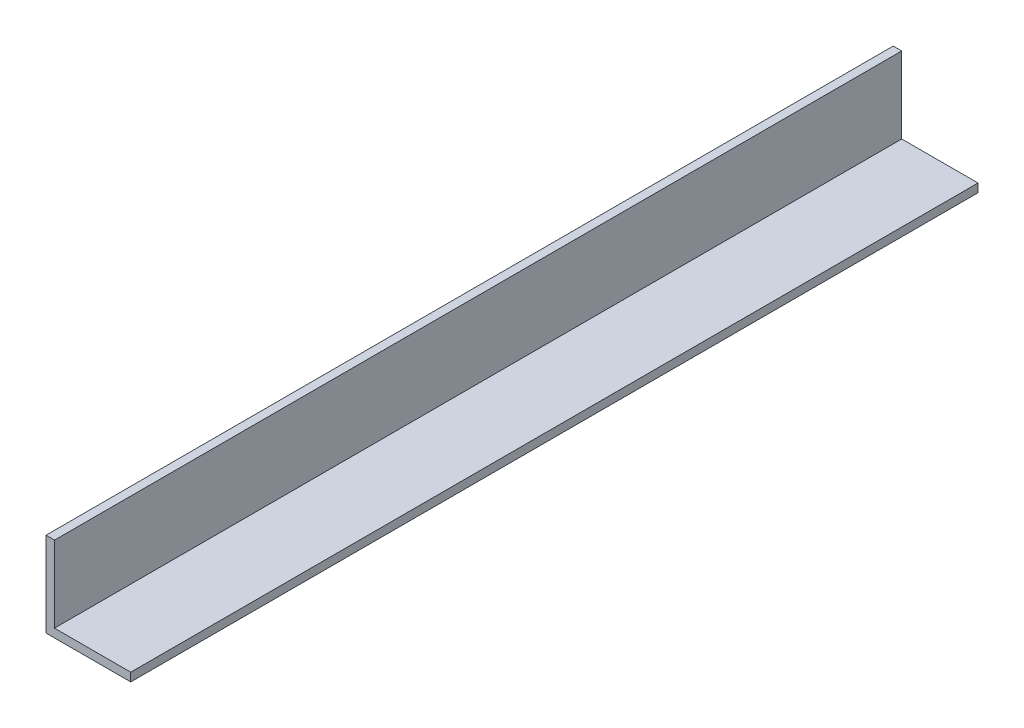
ISO-10303-21;
HEADER;
FILE_DESCRIPTION(('STEP AP214'),'2;1');
FILE_NAME('part.step','',(''),(''),'','','');
FILE_SCHEMA(('AUTOMOTIVE_DESIGN { 1 0 10303 214 1 1 1 1 }'));
ENDSEC;
DATA;
#1=APPLICATION_CONTEXT('core data for automotive mechanical design processes');
#2=APPLICATION_PROTOCOL_DEFINITION('international standard','automotive_design',2000,#1);
#3=PRODUCT_CONTEXT('',#1,'mechanical');
#4=PRODUCT('Part','Part','',(#3));
#5=PRODUCT_RELATED_PRODUCT_CATEGORY('part','',(#4));
#6=PRODUCT_DEFINITION_FORMATION('','',#4);
#7=PRODUCT_DEFINITION_CONTEXT('part definition',#1,'design');
#8=PRODUCT_DEFINITION('design','',#6,#7);
#9=PRODUCT_DEFINITION_SHAPE('','',#8);
#10=(LENGTH_UNIT() NAMED_UNIT(*) SI_UNIT(.MILLI.,.METRE.));
#11=(NAMED_UNIT(*) PLANE_ANGLE_UNIT() SI_UNIT($,.RADIAN.));
#12=(NAMED_UNIT(*) SI_UNIT($,.STERADIAN.) SOLID_ANGLE_UNIT());
#13=UNCERTAINTY_MEASURE_WITH_UNIT(LENGTH_MEASURE(1.E-05),#10,'distance_accuracy_value','');
#14=(GEOMETRIC_REPRESENTATION_CONTEXT(3) GLOBAL_UNCERTAINTY_ASSIGNED_CONTEXT((#13)) GLOBAL_UNIT_ASSIGNED_CONTEXT((#10,
#11,#12)) REPRESENTATION_CONTEXT('',''));
#15=CARTESIAN_POINT('',(0.,0.,0.));
#16=DIRECTION('',(0.,0.,1.));
#17=DIRECTION('',(1.,0.,0.));
#18=AXIS2_PLACEMENT_3D('',#15,#16,#17);
#19=CARTESIAN_POINT('',(27.,0.,150.));
#20=DIRECTION('',(0.,-1.,0.));
#21=DIRECTION('',(1.,0.,0.));
#22=AXIS2_PLACEMENT_3D('',#19,#20,#21);
#23=PLANE('',#22);
#24=DIRECTION('',(-1.,0.,0.));
#25=VECTOR('',#24,1.);
#26=CARTESIAN_POINT('',(27.,0.,-150.));
#27=LINE('',#26,#25);
#28=CARTESIAN_POINT('',(27.,0.,-150.));
#29=VERTEX_POINT('',#28);
#30=CARTESIAN_POINT('',(0.,0.,-150.));
#31=VERTEX_POINT('',#30);
#32=EDGE_CURVE('E120',#29,#31,#27,.T.);
#33=ORIENTED_EDGE('',*,*,#32,.T.);
#34=DIRECTION('',(0.,0.,-1.));
#35=VECTOR('',#34,1.);
#36=CARTESIAN_POINT('',(0.,0.,150.));
#37=LINE('',#36,#35);
#38=CARTESIAN_POINT('',(0.,0.,150.));
#39=VERTEX_POINT('',#38);
#40=EDGE_CURVE('E11',#39,#31,#37,.T.);
#41=ORIENTED_EDGE('',*,*,#40,.F.);
#42=DIRECTION('',(-1.,0.,0.));
#43=VECTOR('',#42,1.);
#44=CARTESIAN_POINT('',(27.,0.,150.));
#45=LINE('',#44,#43);
#46=CARTESIAN_POINT('',(27.,0.,150.));
#47=VERTEX_POINT('',#46);
#48=EDGE_CURVE('E130',#47,#39,#45,.T.);
#49=ORIENTED_EDGE('',*,*,#48,.F.);
#50=DIRECTION('',(0.,0.,-1.));
#51=VECTOR('',#50,1.);
#52=CARTESIAN_POINT('',(27.,0.,150.));
#53=LINE('',#52,#51);
#54=EDGE_CURVE('E116',#47,#29,#53,.T.);
#55=ORIENTED_EDGE('',*,*,#54,.T.);
#56=EDGE_LOOP('',(#33,#41,#49,#55));
#57=FACE_BOUND('',#56,.T.);
#58=ADVANCED_FACE('F36',(#57),#23,.F.);
#59=CARTESIAN_POINT('',(0.,0.,150.));
#60=DIRECTION('',(-1.,0.,0.));
#61=DIRECTION('',(0.,0.,1.));
#62=AXIS2_PLACEMENT_3D('',#59,#60,#61);
#63=PLANE('',#62);
#64=DIRECTION('',(0.,1.,0.));
#65=VECTOR('',#64,1.);
#66=CARTESIAN_POINT('',(0.,0.,-150.));
#67=LINE('',#66,#65);
#68=CARTESIAN_POINT('',(0.,27.,-150.));
#69=VERTEX_POINT('',#68);
#70=EDGE_CURVE('E123',#31,#69,#67,.T.);
#71=ORIENTED_EDGE('',*,*,#70,.T.);
#72=DIRECTION('',(0.,0.,-1.));
#73=VECTOR('',#72,1.);
#74=CARTESIAN_POINT('',(0.,27.,150.));
#75=LINE('',#74,#73);
#76=CARTESIAN_POINT('',(0.,27.,150.));
#77=VERTEX_POINT('',#76);
#78=EDGE_CURVE('E44',#77,#69,#75,.T.);
#79=ORIENTED_EDGE('',*,*,#78,.F.);
#80=DIRECTION('',(0.,1.,0.));
#81=VECTOR('',#80,1.);
#82=CARTESIAN_POINT('',(0.,0.,150.));
#83=LINE('',#82,#81);
#84=EDGE_CURVE('E89',#39,#77,#83,.T.);
#85=ORIENTED_EDGE('',*,*,#84,.F.);
#86=ORIENTED_EDGE('',*,*,#40,.T.);
#87=EDGE_LOOP('',(#71,#79,#85,#86));
#88=FACE_BOUND('',#87,.T.);
#89=ADVANCED_FACE('F154',(#88),#63,.F.);
#90=CARTESIAN_POINT('',(0.,27.,150.));
#91=DIRECTION('',(0.,-1.,0.));
#92=DIRECTION('',(0.,0.,-1.));
#93=AXIS2_PLACEMENT_3D('',#90,#91,#92);
#94=PLANE('',#93);
#95=DIRECTION('',(-1.,0.,0.));
#96=VECTOR('',#95,1.);
#97=CARTESIAN_POINT('',(0.,27.,-150.));
#98=LINE('',#97,#96);
#99=CARTESIAN_POINT('',(-3.,27.,-150.));
#100=VERTEX_POINT('',#99);
#101=EDGE_CURVE('E125',#69,#100,#98,.T.);
#102=ORIENTED_EDGE('',*,*,#101,.T.);
#103=DIRECTION('',(0.,0.,-1.));
#104=VECTOR('',#103,1.);
#105=CARTESIAN_POINT('',(-3.,27.,150.));
#106=LINE('',#105,#104);
#107=CARTESIAN_POINT('',(-3.,27.,150.));
#108=VERTEX_POINT('',#107);
#109=EDGE_CURVE('E111',#108,#100,#106,.T.);
#110=ORIENTED_EDGE('',*,*,#109,.F.);
#111=DIRECTION('',(-1.,0.,0.));
#112=VECTOR('',#111,1.);
#113=CARTESIAN_POINT('',(0.,27.,150.));
#114=LINE('',#113,#112);
#115=EDGE_CURVE('E102',#77,#108,#114,.T.);
#116=ORIENTED_EDGE('',*,*,#115,.F.);
#117=ORIENTED_EDGE('',*,*,#78,.T.);
#118=EDGE_LOOP('',(#102,#110,#116,#117));
#119=FACE_BOUND('',#118,.T.);
#120=ADVANCED_FACE('F136',(#119),#94,.F.);
#121=CARTESIAN_POINT('',(-3.,27.,150.));
#122=DIRECTION('',(1.,0.,0.));
#123=DIRECTION('',(0.,1.,0.));
#124=AXIS2_PLACEMENT_3D('',#121,#122,#123);
#125=PLANE('',#124);
#126=DIRECTION('',(0.,-1.,0.));
#127=VECTOR('',#126,1.);
#128=CARTESIAN_POINT('',(-3.,27.,-150.));
#129=LINE('',#128,#127);
#130=CARTESIAN_POINT('',(-3.,-3.,-150.));
#131=VERTEX_POINT('',#130);
#132=EDGE_CURVE('E110',#100,#131,#129,.T.);
#133=ORIENTED_EDGE('',*,*,#132,.T.);
#134=DIRECTION('',(0.,0.,-1.));
#135=VECTOR('',#134,1.);
#136=CARTESIAN_POINT('',(-3.,-3.,150.));
#137=LINE('',#136,#135);
#138=CARTESIAN_POINT('',(-3.,-3.,150.));
#139=VERTEX_POINT('',#138);
#140=EDGE_CURVE('E107',#139,#131,#137,.T.);
#141=ORIENTED_EDGE('',*,*,#140,.F.);
#142=DIRECTION('',(0.,-1.,0.));
#143=VECTOR('',#142,1.);
#144=CARTESIAN_POINT('',(-3.,27.,150.));
#145=LINE('',#144,#143);
#146=EDGE_CURVE('E96',#108,#139,#145,.T.);
#147=ORIENTED_EDGE('',*,*,#146,.F.);
#148=ORIENTED_EDGE('',*,*,#109,.T.);
#149=EDGE_LOOP('',(#133,#141,#147,#148));
#150=FACE_BOUND('',#149,.T.);
#151=ADVANCED_FACE('F108',(#150),#125,.F.);
#152=CARTESIAN_POINT('',(-3.,-3.,150.));
#153=DIRECTION('',(0.,1.,0.));
#154=DIRECTION('',(0.,0.,1.));
#155=AXIS2_PLACEMENT_3D('',#152,#153,#154);
#156=PLANE('',#155);
#157=DIRECTION('',(1.,0.,0.));
#158=VECTOR('',#157,1.);
#159=CARTESIAN_POINT('',(-3.,-3.,-150.));
#160=LINE('',#159,#158);
#161=CARTESIAN_POINT('',(27.,-3.,-150.));
#162=VERTEX_POINT('',#161);
#163=EDGE_CURVE('E75',#131,#162,#160,.T.);
#164=ORIENTED_EDGE('',*,*,#163,.T.);
#165=DIRECTION('',(0.,0.,-1.));
#166=VECTOR('',#165,1.);
#167=CARTESIAN_POINT('',(27.,-3.,150.));
#168=LINE('',#167,#166);
#169=CARTESIAN_POINT('',(27.,-3.,150.));
#170=VERTEX_POINT('',#169);
#171=EDGE_CURVE('E112',#170,#162,#168,.T.);
#172=ORIENTED_EDGE('',*,*,#171,.F.);
#173=DIRECTION('',(1.,0.,0.));
#174=VECTOR('',#173,1.);
#175=CARTESIAN_POINT('',(-3.,-3.,150.));
#176=LINE('',#175,#174);
#177=EDGE_CURVE('E100',#139,#170,#176,.T.);
#178=ORIENTED_EDGE('',*,*,#177,.F.);
#179=ORIENTED_EDGE('',*,*,#140,.T.);
#180=EDGE_LOOP('',(#164,#172,#178,#179));
#181=FACE_BOUND('',#180,.T.);
#182=ADVANCED_FACE('F114',(#181),#156,.F.);
#183=CARTESIAN_POINT('',(27.,-3.,150.));
#184=DIRECTION('',(-1.,0.,0.));
#185=DIRECTION('',(0.,0.,1.));
#186=AXIS2_PLACEMENT_3D('',#183,#184,#185);
#187=PLANE('',#186);
#188=DIRECTION('',(0.,1.,0.));
#189=VECTOR('',#188,1.);
#190=CARTESIAN_POINT('',(27.,-3.,-150.));
#191=LINE('',#190,#189);
#192=EDGE_CURVE('E81',#162,#29,#191,.T.);
#193=ORIENTED_EDGE('',*,*,#192,.T.);
#194=ORIENTED_EDGE('',*,*,#54,.F.);
#195=DIRECTION('',(0.,1.,0.));
#196=VECTOR('',#195,1.);
#197=CARTESIAN_POINT('',(27.,-3.,150.));
#198=LINE('',#197,#196);
#199=EDGE_CURVE('E52',#170,#47,#198,.T.);
#200=ORIENTED_EDGE('',*,*,#199,.F.);
#201=ORIENTED_EDGE('',*,*,#171,.T.);
#202=EDGE_LOOP('',(#193,#194,#200,#201));
#203=FACE_BOUND('',#202,.T.);
#204=ADVANCED_FACE('F143',(#203),#187,.F.);
#205=CARTESIAN_POINT('',(0.,0.,150.));
#206=DIRECTION('',(0.,0.,-1.));
#207=DIRECTION('',(-1.,0.,0.));
#208=AXIS2_PLACEMENT_3D('',#205,#206,#207);
#209=PLANE('',#208);
#210=ORIENTED_EDGE('',*,*,#48,.T.);
#211=ORIENTED_EDGE('',*,*,#84,.T.);
#212=ORIENTED_EDGE('',*,*,#115,.T.);
#213=ORIENTED_EDGE('',*,*,#146,.T.);
#214=ORIENTED_EDGE('',*,*,#177,.T.);
#215=ORIENTED_EDGE('',*,*,#199,.T.);
#216=EDGE_LOOP('',(#210,#211,#212,#213,#214,#215));
#217=FACE_BOUND('',#216,.T.);
#218=ADVANCED_FACE('F98',(#217),#209,.F.);
#219=CARTESIAN_POINT('',(0.,0.,-150.));
#220=DIRECTION('',(0.,0.,-1.));
#221=DIRECTION('',(-1.,0.,0.));
#222=AXIS2_PLACEMENT_3D('',#219,#220,#221);
#223=PLANE('',#222);
#224=ORIENTED_EDGE('',*,*,#32,.F.);
#225=ORIENTED_EDGE('',*,*,#192,.F.);
#226=ORIENTED_EDGE('',*,*,#163,.F.);
#227=ORIENTED_EDGE('',*,*,#132,.F.);
#228=ORIENTED_EDGE('',*,*,#101,.F.);
#229=ORIENTED_EDGE('',*,*,#70,.F.);
#230=EDGE_LOOP('',(#224,#225,#226,#227,#228,#229));
#231=FACE_BOUND('',#230,.T.);
#232=ADVANCED_FACE('F139',(#231),#223,.T.);
#233=CLOSED_SHELL('',(#58,#89,#120,#151,#182,#204,#218,#232));
#234=MANIFOLD_SOLID_BREP('B2',#233);
#235=ADVANCED_BREP_SHAPE_REPRESENTATION('',(#18,#234),#14);
#236=SHAPE_DEFINITION_REPRESENTATION(#9,#235);
ENDSEC;
END-ISO-10303-21;
